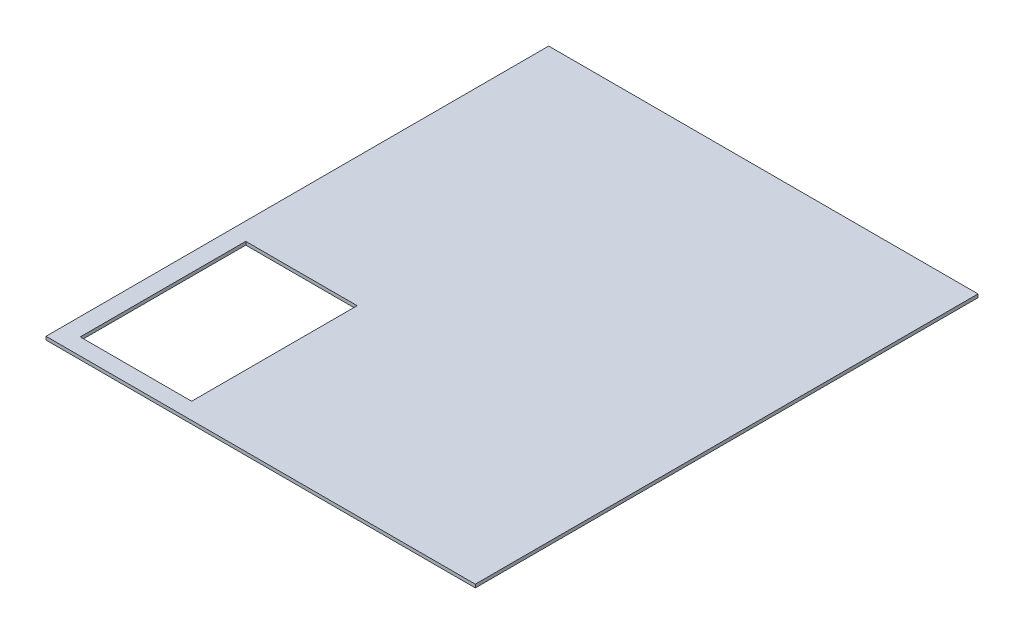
ISO-10303-21;
HEADER;
FILE_DESCRIPTION(('STEP AP214'),'2;1');
FILE_NAME('part.step','',(''),(''),'','','');
FILE_SCHEMA(('AUTOMOTIVE_DESIGN { 1 0 10303 214 1 1 1 1 }'));
ENDSEC;
DATA;
#1=APPLICATION_CONTEXT('core data for automotive mechanical design processes');
#2=APPLICATION_PROTOCOL_DEFINITION('international standard','automotive_design',2000,#1);
#3=PRODUCT_CONTEXT('',#1,'mechanical');
#4=PRODUCT('Part','Part','',(#3));
#5=PRODUCT_RELATED_PRODUCT_CATEGORY('part','',(#4));
#6=PRODUCT_DEFINITION_FORMATION('','',#4);
#7=PRODUCT_DEFINITION_CONTEXT('part definition',#1,'design');
#8=PRODUCT_DEFINITION('design','',#6,#7);
#9=PRODUCT_DEFINITION_SHAPE('','',#8);
#10=(LENGTH_UNIT() NAMED_UNIT(*) SI_UNIT(.MILLI.,.METRE.));
#11=(NAMED_UNIT(*) PLANE_ANGLE_UNIT() SI_UNIT($,.RADIAN.));
#12=(NAMED_UNIT(*) SI_UNIT($,.STERADIAN.) SOLID_ANGLE_UNIT());
#13=UNCERTAINTY_MEASURE_WITH_UNIT(LENGTH_MEASURE(1.E-05),#10,'distance_accuracy_value','');
#14=(GEOMETRIC_REPRESENTATION_CONTEXT(3) GLOBAL_UNCERTAINTY_ASSIGNED_CONTEXT((#13)) GLOBAL_UNIT_ASSIGNED_CONTEXT((#10,
#11,#12)) REPRESENTATION_CONTEXT('',''));
#15=CARTESIAN_POINT('',(0.,0.,0.));
#16=DIRECTION('',(0.,0.,1.));
#17=DIRECTION('',(1.,0.,0.));
#18=AXIS2_PLACEMENT_3D('',#15,#16,#17);
#19=CARTESIAN_POINT('',(0.,3.,0.));
#20=DIRECTION('',(1.,0.,0.));
#21=DIRECTION('',(0.,0.,-1.));
#22=AXIS2_PLACEMENT_3D('',#19,#20,#21);
#23=PLANE('',#22);
#24=DIRECTION('',(0.,0.,1.));
#25=VECTOR('',#24,1.);
#26=CARTESIAN_POINT('',(0.,0.,0.));
#27=LINE('',#26,#25);
#28=CARTESIAN_POINT('',(0.,0.,-455.5));
#29=VERTEX_POINT('',#28);
#30=CARTESIAN_POINT('',(0.,0.,0.));
#31=VERTEX_POINT('',#30);
#32=EDGE_CURVE('E152',#29,#31,#27,.T.);
#33=ORIENTED_EDGE('',*,*,#32,.T.);
#34=DIRECTION('',(0.,-1.,0.));
#35=VECTOR('',#34,1.);
#36=CARTESIAN_POINT('',(0.,3.,0.));
#37=LINE('',#36,#35);
#38=CARTESIAN_POINT('',(0.,3.,0.));
#39=VERTEX_POINT('',#38);
#40=EDGE_CURVE('E11',#39,#31,#37,.T.);
#41=ORIENTED_EDGE('',*,*,#40,.F.);
#42=DIRECTION('',(0.,0.,1.));
#43=VECTOR('',#42,1.);
#44=CARTESIAN_POINT('',(0.,3.,0.));
#45=LINE('',#44,#43);
#46=CARTESIAN_POINT('',(0.,3.,-455.5));
#47=VERTEX_POINT('',#46);
#48=EDGE_CURVE('E158',#47,#39,#45,.T.);
#49=ORIENTED_EDGE('',*,*,#48,.F.);
#50=DIRECTION('',(0.,-1.,0.));
#51=VECTOR('',#50,1.);
#52=CARTESIAN_POINT('',(0.,3.,-455.5));
#53=LINE('',#52,#51);
#54=EDGE_CURVE('E172',#47,#29,#53,.T.);
#55=ORIENTED_EDGE('',*,*,#54,.T.);
#56=EDGE_LOOP('',(#33,#41,#49,#55));
#57=FACE_BOUND('',#56,.T.);
#58=ADVANCED_FACE('F44',(#57),#23,.F.);
#59=CARTESIAN_POINT('',(0.,3.,0.));
#60=DIRECTION('',(0.,0.,-1.));
#61=DIRECTION('',(-1.,0.,0.));
#62=AXIS2_PLACEMENT_3D('',#59,#60,#61);
#63=PLANE('',#62);
#64=DIRECTION('',(1.,0.,0.));
#65=VECTOR('',#64,1.);
#66=CARTESIAN_POINT('',(0.,0.,0.));
#67=LINE('',#66,#65);
#68=CARTESIAN_POINT('',(389.,0.,0.));
#69=VERTEX_POINT('',#68);
#70=EDGE_CURVE('E176',#31,#69,#67,.T.);
#71=ORIENTED_EDGE('',*,*,#70,.T.);
#72=DIRECTION('',(0.,-1.,0.));
#73=VECTOR('',#72,1.);
#74=CARTESIAN_POINT('',(389.,3.,0.));
#75=LINE('',#74,#73);
#76=CARTESIAN_POINT('',(389.,3.,0.));
#77=VERTEX_POINT('',#76);
#78=EDGE_CURVE('E52',#77,#69,#75,.T.);
#79=ORIENTED_EDGE('',*,*,#78,.F.);
#80=DIRECTION('',(1.,0.,0.));
#81=VECTOR('',#80,1.);
#82=CARTESIAN_POINT('',(0.,3.,0.));
#83=LINE('',#82,#81);
#84=EDGE_CURVE('E162',#39,#77,#83,.T.);
#85=ORIENTED_EDGE('',*,*,#84,.F.);
#86=ORIENTED_EDGE('',*,*,#40,.T.);
#87=EDGE_LOOP('',(#71,#79,#85,#86));
#88=FACE_BOUND('',#87,.T.);
#89=ADVANCED_FACE('F210',(#88),#63,.F.);
#90=CARTESIAN_POINT('',(389.,3.,0.));
#91=DIRECTION('',(-1.,0.,0.));
#92=DIRECTION('',(0.,0.,1.));
#93=AXIS2_PLACEMENT_3D('',#90,#91,#92);
#94=PLANE('',#93);
#95=DIRECTION('',(0.,0.,-1.));
#96=VECTOR('',#95,1.);
#97=CARTESIAN_POINT('',(389.,0.,0.));
#98=LINE('',#97,#96);
#99=CARTESIAN_POINT('',(389.,0.,-455.5));
#100=VERTEX_POINT('',#99);
#101=EDGE_CURVE('E179',#69,#100,#98,.T.);
#102=ORIENTED_EDGE('',*,*,#101,.T.);
#103=DIRECTION('',(0.,-1.,0.));
#104=VECTOR('',#103,1.);
#105=CARTESIAN_POINT('',(389.,3.,-455.5));
#106=LINE('',#105,#104);
#107=CARTESIAN_POINT('',(389.,3.,-455.5));
#108=VERTEX_POINT('',#107);
#109=EDGE_CURVE('E187',#108,#100,#106,.T.);
#110=ORIENTED_EDGE('',*,*,#109,.F.);
#111=DIRECTION('',(0.,0.,-1.));
#112=VECTOR('',#111,1.);
#113=CARTESIAN_POINT('',(389.,3.,0.));
#114=LINE('',#113,#112);
#115=EDGE_CURVE('E166',#77,#108,#114,.T.);
#116=ORIENTED_EDGE('',*,*,#115,.F.);
#117=ORIENTED_EDGE('',*,*,#78,.T.);
#118=EDGE_LOOP('',(#102,#110,#116,#117));
#119=FACE_BOUND('',#118,.T.);
#120=ADVANCED_FACE('F196',(#119),#94,.F.);
#121=CARTESIAN_POINT('',(0.,3.,-455.5));
#122=DIRECTION('',(0.,0.,1.));
#123=DIRECTION('',(1.,0.,0.));
#124=AXIS2_PLACEMENT_3D('',#121,#122,#123);
#125=PLANE('',#124);
#126=DIRECTION('',(-1.,0.,0.));
#127=VECTOR('',#126,1.);
#128=CARTESIAN_POINT('',(0.,0.,-455.5));
#129=LINE('',#128,#127);
#130=EDGE_CURVE('E163',#100,#29,#129,.T.);
#131=ORIENTED_EDGE('',*,*,#130,.T.);
#132=ORIENTED_EDGE('',*,*,#54,.F.);
#133=DIRECTION('',(-1.,0.,0.));
#134=VECTOR('',#133,1.);
#135=CARTESIAN_POINT('',(0.,3.,-455.5));
#136=LINE('',#135,#134);
#137=EDGE_CURVE('E169',#108,#47,#136,.T.);
#138=ORIENTED_EDGE('',*,*,#137,.F.);
#139=ORIENTED_EDGE('',*,*,#109,.T.);
#140=EDGE_LOOP('',(#131,#132,#138,#139));
#141=FACE_BOUND('',#140,.T.);
#142=ADVANCED_FACE('F203',(#141),#125,.F.);
#143=CARTESIAN_POINT('',(0.,3.,0.));
#144=DIRECTION('',(0.,-1.,0.));
#145=DIRECTION('',(0.,0.,-1.));
#146=AXIS2_PLACEMENT_3D('',#143,#144,#145);
#147=PLANE('',#146);
#148=DIRECTION('',(1.,0.,0.));
#149=VECTOR('',#148,1.);
#150=CARTESIAN_POINT('',(16.,3.,-15.));
#151=LINE('',#150,#149);
#152=CARTESIAN_POINT('',(16.,3.,-15.));
#153=VERTEX_POINT('',#152);
#154=CARTESIAN_POINT('',(116.96015000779,3.,-15.));
#155=VERTEX_POINT('',#154);
#156=EDGE_CURVE('E143',#153,#155,#151,.T.);
#157=ORIENTED_EDGE('',*,*,#156,.F.);
#158=DIRECTION('',(0.,0.,1.));
#159=VECTOR('',#158,1.);
#160=CARTESIAN_POINT('',(16.,3.,-15.));
#161=LINE('',#160,#159);
#162=CARTESIAN_POINT('',(16.,3.,-165.));
#163=VERTEX_POINT('',#162);
#164=EDGE_CURVE('E59',#163,#153,#161,.T.);
#165=ORIENTED_EDGE('',*,*,#164,.F.);
#166=DIRECTION('',(-1.,0.,0.));
#167=VECTOR('',#166,1.);
#168=CARTESIAN_POINT('',(16.,3.,-165.));
#169=LINE('',#168,#167);
#170=CARTESIAN_POINT('',(116.96015000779,3.,-165.));
#171=VERTEX_POINT('',#170);
#172=EDGE_CURVE('E130',#171,#163,#169,.T.);
#173=ORIENTED_EDGE('',*,*,#172,.F.);
#174=DIRECTION('',(0.,0.,-1.));
#175=VECTOR('',#174,1.);
#176=CARTESIAN_POINT('',(116.96015000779,3.,-15.));
#177=LINE('',#176,#175);
#178=EDGE_CURVE('E134',#155,#171,#177,.T.);
#179=ORIENTED_EDGE('',*,*,#178,.F.);
#180=EDGE_LOOP('',(#157,#165,#173,#179));
#181=FACE_BOUND('',#180,.T.);
#182=ORIENTED_EDGE('',*,*,#48,.T.);
#183=ORIENTED_EDGE('',*,*,#84,.T.);
#184=ORIENTED_EDGE('',*,*,#115,.T.);
#185=ORIENTED_EDGE('',*,*,#137,.T.);
#186=EDGE_LOOP('',(#182,#183,#184,#185));
#187=FACE_BOUND('',#186,.T.);
#188=ADVANCED_FACE('F209',(#181,#187),#147,.F.);
#189=CARTESIAN_POINT('',(0.,0.,0.));
#190=DIRECTION('',(0.,-1.,0.));
#191=DIRECTION('',(0.,0.,-1.));
#192=AXIS2_PLACEMENT_3D('',#189,#190,#191);
#193=PLANE('',#192);
#194=DIRECTION('',(0.,0.,1.));
#195=VECTOR('',#194,1.);
#196=CARTESIAN_POINT('',(16.,0.,-15.));
#197=LINE('',#196,#195);
#198=CARTESIAN_POINT('',(16.,0.,-165.));
#199=VERTEX_POINT('',#198);
#200=CARTESIAN_POINT('',(16.,0.,-15.));
#201=VERTEX_POINT('',#200);
#202=EDGE_CURVE('E111',#199,#201,#197,.T.);
#203=ORIENTED_EDGE('',*,*,#202,.T.);
#204=DIRECTION('',(1.,0.,0.));
#205=VECTOR('',#204,1.);
#206=CARTESIAN_POINT('',(16.,0.,-15.));
#207=LINE('',#206,#205);
#208=CARTESIAN_POINT('',(116.96015000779,0.,-15.));
#209=VERTEX_POINT('',#208);
#210=EDGE_CURVE('E121',#201,#209,#207,.T.);
#211=ORIENTED_EDGE('',*,*,#210,.T.);
#212=DIRECTION('',(0.,0.,-1.));
#213=VECTOR('',#212,1.);
#214=CARTESIAN_POINT('',(116.96015000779,0.,-15.));
#215=LINE('',#214,#213);
#216=CARTESIAN_POINT('',(116.96015000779,0.,-165.));
#217=VERTEX_POINT('',#216);
#218=EDGE_CURVE('E67',#209,#217,#215,.T.);
#219=ORIENTED_EDGE('',*,*,#218,.T.);
#220=DIRECTION('',(-1.,0.,0.));
#221=VECTOR('',#220,1.);
#222=CARTESIAN_POINT('',(16.,0.,-165.));
#223=LINE('',#222,#221);
#224=EDGE_CURVE('E118',#217,#199,#223,.T.);
#225=ORIENTED_EDGE('',*,*,#224,.T.);
#226=EDGE_LOOP('',(#203,#211,#219,#225));
#227=FACE_BOUND('',#226,.T.);
#228=ORIENTED_EDGE('',*,*,#32,.F.);
#229=ORIENTED_EDGE('',*,*,#130,.F.);
#230=ORIENTED_EDGE('',*,*,#101,.F.);
#231=ORIENTED_EDGE('',*,*,#70,.F.);
#232=EDGE_LOOP('',(#228,#229,#230,#231));
#233=FACE_BOUND('',#232,.T.);
#234=ADVANCED_FACE('F126',(#227,#233),#193,.T.);
#235=CARTESIAN_POINT('',(16.,0.,-15.));
#236=DIRECTION('',(-1.,0.,0.));
#237=DIRECTION('',(0.,0.,1.));
#238=AXIS2_PLACEMENT_3D('',#235,#236,#237);
#239=PLANE('',#238);
#240=ORIENTED_EDGE('',*,*,#164,.T.);
#241=DIRECTION('',(0.,1.,0.));
#242=VECTOR('',#241,1.);
#243=CARTESIAN_POINT('',(16.,0.,-15.));
#244=LINE('',#243,#242);
#245=EDGE_CURVE('E107',#201,#153,#244,.T.);
#246=ORIENTED_EDGE('',*,*,#245,.F.);
#247=ORIENTED_EDGE('',*,*,#202,.F.);
#248=DIRECTION('',(0.,1.,0.));
#249=VECTOR('',#248,1.);
#250=CARTESIAN_POINT('',(16.,0.,-165.));
#251=LINE('',#250,#249);
#252=EDGE_CURVE('E149',#199,#163,#251,.T.);
#253=ORIENTED_EDGE('',*,*,#252,.T.);
#254=EDGE_LOOP('',(#240,#246,#247,#253));
#255=FACE_BOUND('',#254,.T.);
#256=ADVANCED_FACE('F109',(#255),#239,.F.);
#257=CARTESIAN_POINT('',(16.,0.,-165.));
#258=DIRECTION('',(0.,0.,-1.));
#259=DIRECTION('',(-1.,0.,0.));
#260=AXIS2_PLACEMENT_3D('',#257,#258,#259);
#261=PLANE('',#260);
#262=ORIENTED_EDGE('',*,*,#172,.T.);
#263=ORIENTED_EDGE('',*,*,#252,.F.);
#264=ORIENTED_EDGE('',*,*,#224,.F.);
#265=DIRECTION('',(0.,1.,0.));
#266=VECTOR('',#265,1.);
#267=CARTESIAN_POINT('',(116.96015000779,0.,-165.));
#268=LINE('',#267,#266);
#269=EDGE_CURVE('E153',#217,#171,#268,.T.);
#270=ORIENTED_EDGE('',*,*,#269,.T.);
#271=EDGE_LOOP('',(#262,#263,#264,#270));
#272=FACE_BOUND('',#271,.T.);
#273=ADVANCED_FACE('F227',(#272),#261,.F.);
#274=CARTESIAN_POINT('',(116.96015000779,0.,-15.));
#275=DIRECTION('',(1.,0.,0.));
#276=DIRECTION('',(0.,0.,-1.));
#277=AXIS2_PLACEMENT_3D('',#274,#275,#276);
#278=PLANE('',#277);
#279=ORIENTED_EDGE('',*,*,#178,.T.);
#280=ORIENTED_EDGE('',*,*,#269,.F.);
#281=ORIENTED_EDGE('',*,*,#218,.F.);
#282=DIRECTION('',(0.,1.,0.));
#283=VECTOR('',#282,1.);
#284=CARTESIAN_POINT('',(116.96015000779,0.,-15.));
#285=LINE('',#284,#283);
#286=EDGE_CURVE('E117',#209,#155,#285,.T.);
#287=ORIENTED_EDGE('',*,*,#286,.T.);
#288=EDGE_LOOP('',(#279,#280,#281,#287));
#289=FACE_BOUND('',#288,.T.);
#290=ADVANCED_FACE('F230',(#289),#278,.F.);
#291=CARTESIAN_POINT('',(16.,0.,-15.));
#292=DIRECTION('',(0.,0.,1.));
#293=DIRECTION('',(1.,0.,0.));
#294=AXIS2_PLACEMENT_3D('',#291,#292,#293);
#295=PLANE('',#294);
#296=ORIENTED_EDGE('',*,*,#156,.T.);
#297=ORIENTED_EDGE('',*,*,#286,.F.);
#298=ORIENTED_EDGE('',*,*,#210,.F.);
#299=ORIENTED_EDGE('',*,*,#245,.T.);
#300=EDGE_LOOP('',(#296,#297,#298,#299));
#301=FACE_BOUND('',#300,.T.);
#302=ADVANCED_FACE('F122',(#301),#295,.F.);
#303=CLOSED_SHELL('',(#58,#89,#120,#142,#188,#234,#256,#273,#290,#302));
#304=MANIFOLD_SOLID_BREP('B2',#303);
#305=ADVANCED_BREP_SHAPE_REPRESENTATION('',(#18,#304),#14);
#306=SHAPE_DEFINITION_REPRESENTATION(#9,#305);
ENDSEC;
END-ISO-10303-21;
